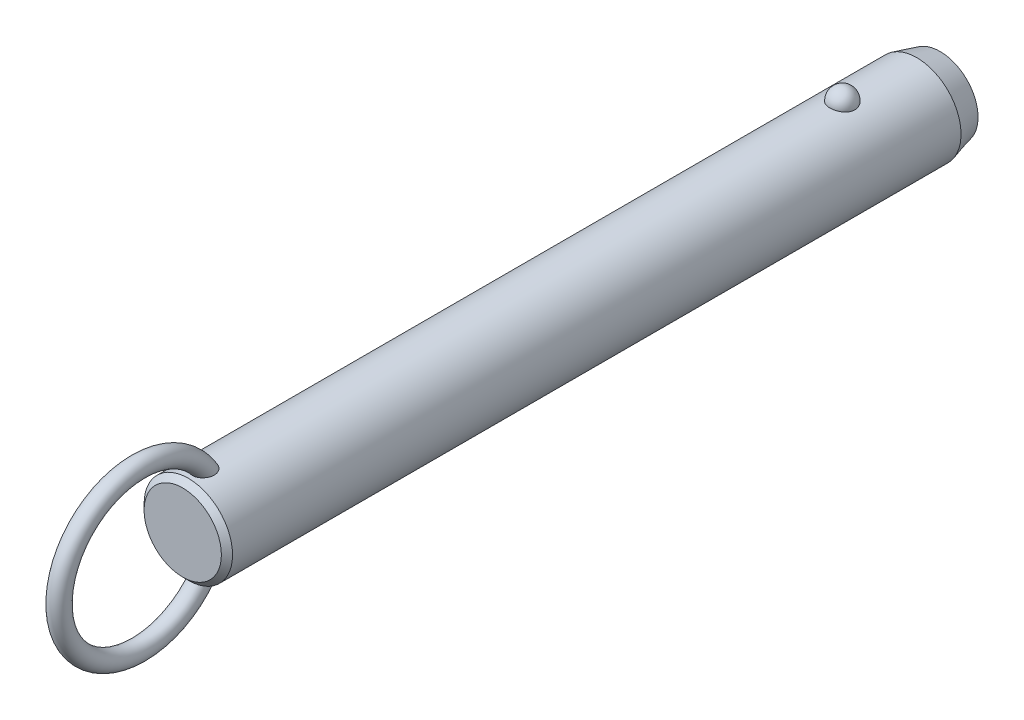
ISO-10303-21;
HEADER;
FILE_DESCRIPTION(('STEP AP214'),'2;1');
FILE_NAME('part.step','',(''),(''),'','','');
FILE_SCHEMA(('AUTOMOTIVE_DESIGN { 1 0 10303 214 1 1 1 1 }'));
ENDSEC;
DATA;
#1=APPLICATION_CONTEXT('core data for automotive mechanical design processes');
#2=APPLICATION_PROTOCOL_DEFINITION('international standard','automotive_design',2000,#1);
#3=PRODUCT_CONTEXT('',#1,'mechanical');
#4=PRODUCT('Part','Part','',(#3));
#5=PRODUCT_RELATED_PRODUCT_CATEGORY('part','',(#4));
#6=PRODUCT_DEFINITION_FORMATION('','',#4);
#7=PRODUCT_DEFINITION_CONTEXT('part definition',#1,'design');
#8=PRODUCT_DEFINITION('design','',#6,#7);
#9=PRODUCT_DEFINITION_SHAPE('','',#8);
#10=(LENGTH_UNIT() NAMED_UNIT(*) SI_UNIT(.MILLI.,.METRE.));
#11=(NAMED_UNIT(*) PLANE_ANGLE_UNIT() SI_UNIT($,.RADIAN.));
#12=(NAMED_UNIT(*) SI_UNIT($,.STERADIAN.) SOLID_ANGLE_UNIT());
#13=UNCERTAINTY_MEASURE_WITH_UNIT(LENGTH_MEASURE(1.E-05),#10,'distance_accuracy_value','');
#14=(GEOMETRIC_REPRESENTATION_CONTEXT(3) GLOBAL_UNCERTAINTY_ASSIGNED_CONTEXT((#13)) GLOBAL_UNIT_ASSIGNED_CONTEXT((#10,
#11,#12)) REPRESENTATION_CONTEXT('',''));
#15=CARTESIAN_POINT('',(0.,0.,0.));
#16=DIRECTION('',(0.,0.,1.));
#17=DIRECTION('',(1.,0.,0.));
#18=AXIS2_PLACEMENT_3D('',#15,#16,#17);
#19=CARTESIAN_POINT('',(0.,0.,129.5));
#20=DIRECTION('',(0.,0.,-1.));
#21=DIRECTION('',(-1.,0.,0.));
#22=AXIS2_PLACEMENT_3D('',#19,#20,#21);
#23=CYLINDRICAL_SURFACE('',#22,9.5);
#24=CARTESIAN_POINT('',(2.67259918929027,9.11631578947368,-2.70000000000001));
#25=CARTESIAN_POINT('',(2.6725968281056,9.11631786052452,-2.54909854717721));
#26=CARTESIAN_POINT('',(2.66030567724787,9.11994722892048,-2.39816735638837));
#27=CARTESIAN_POINT('',(2.6114347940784,9.13405924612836,-2.10058568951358));
#28=CARTESIAN_POINT('',(2.57484658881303,9.14454428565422,-1.95393672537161));
#29=CARTESIAN_POINT('',(2.47830875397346,9.17117631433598,-1.66916069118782));
#30=CARTESIAN_POINT('',(2.41836936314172,9.18732082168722,-1.53102991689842));
#31=CARTESIAN_POINT('',(2.27661331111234,9.22346780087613,-1.26705393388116));
#32=CARTESIAN_POINT('',(2.19479699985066,9.24347021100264,-1.14120852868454));
#33=CARTESIAN_POINT('',(2.01085282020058,9.28522401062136,-0.904632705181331));
#34=CARTESIAN_POINT('',(1.90862396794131,9.30698376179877,-0.793982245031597));
#35=CARTESIAN_POINT('',(1.6867437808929,9.34973971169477,-0.591607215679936));
#36=CARTESIAN_POINT('',(1.56709244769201,9.37073591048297,-0.499882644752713));
#37=CARTESIAN_POINT('',(1.31393976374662,9.40956370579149,-0.338167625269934));
#38=CARTESIAN_POINT('',(1.18048026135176,9.42740444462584,-0.268113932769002));
#39=CARTESIAN_POINT('',(0.903154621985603,9.45799906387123,-0.151390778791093));
#40=CARTESIAN_POINT('',(0.759289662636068,9.47075351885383,-0.104718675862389));
#41=CARTESIAN_POINT('',(0.468074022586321,9.48956256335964,-0.0367633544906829));
#42=CARTESIAN_POINT('',(0.320836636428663,9.49573643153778,-0.0150275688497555));
#43=CARTESIAN_POINT('',(0.0246714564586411,9.50112183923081,0.00396199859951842));
#44=CARTESIAN_POINT('',(-0.124256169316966,9.50033406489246,0.00121819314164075));
#45=CARTESIAN_POINT('',(-0.417264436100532,9.4919475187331,-0.0284441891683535));
#46=CARTESIAN_POINT('',(-0.56138413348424,9.48444885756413,-0.0550074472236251));
#47=CARTESIAN_POINT('',(-0.842986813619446,9.46357853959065,-0.131064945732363));
#48=CARTESIAN_POINT('',(-0.980469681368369,9.450206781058,-0.180559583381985));
#49=CARTESIAN_POINT('',(-1.24585005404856,9.41890822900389,-0.301476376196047));
#50=CARTESIAN_POINT('',(-1.37368611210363,9.40095498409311,-0.373026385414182));
#51=CARTESIAN_POINT('',(-1.61552738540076,9.36242964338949,-0.536025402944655));
#52=CARTESIAN_POINT('',(-1.72953116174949,9.34185727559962,-0.627476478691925));
#53=CARTESIAN_POINT('',(-1.9429225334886,9.29984568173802,-0.829844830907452));
#54=CARTESIAN_POINT('',(-2.04198021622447,9.27839736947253,-0.94110821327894));
#55=CARTESIAN_POINT('',(-2.22026460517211,9.23735994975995,-1.17883414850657));
#56=CARTESIAN_POINT('',(-2.29948985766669,9.21777097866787,-1.30529781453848));
#57=CARTESIAN_POINT('',(-2.43697287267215,9.18238994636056,-1.57158566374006));
#58=CARTESIAN_POINT('',(-2.49497068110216,9.16664569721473,-1.71155057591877));
#59=CARTESIAN_POINT('',(-2.5872073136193,9.14104303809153,-1.99961197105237));
#60=CARTESIAN_POINT('',(-2.62144683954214,9.13118445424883,-2.14770821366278));
#61=CARTESIAN_POINT('',(-2.66521466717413,9.11850622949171,-2.44715424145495));
#62=CARTESIAN_POINT('',(-2.67484831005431,9.11565658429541,-2.59848735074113));
#63=CARTESIAN_POINT('',(-2.66946735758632,9.11723375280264,-2.90067317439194));
#64=CARTESIAN_POINT('',(-2.65445345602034,9.12166036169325,-3.05152590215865));
#65=CARTESIAN_POINT('',(-2.60029711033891,9.13724422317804,-3.34766110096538));
#66=CARTESIAN_POINT('',(-2.56127978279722,9.14836656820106,-3.49296833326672));
#67=CARTESIAN_POINT('',(-2.46018844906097,9.17606676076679,-3.77477535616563));
#68=CARTESIAN_POINT('',(-2.39811349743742,9.1926448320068,-3.9112747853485));
#69=CARTESIAN_POINT('',(-2.25202303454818,9.22952198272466,-4.17244273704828));
#70=CARTESIAN_POINT('',(-2.16788714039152,9.24984129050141,-4.29704106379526));
#71=CARTESIAN_POINT('',(-1.9799408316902,9.29188255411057,-4.53013066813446));
#72=CARTESIAN_POINT('',(-1.87612963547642,9.31360456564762,-4.63862130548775));
#73=CARTESIAN_POINT('',(-1.65105429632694,9.35612959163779,-4.8369029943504));
#74=CARTESIAN_POINT('',(-1.52972405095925,9.37692871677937,-4.92661991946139));
#75=CARTESIAN_POINT('',(-1.27318250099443,9.41518970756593,-5.08429106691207));
#76=CARTESIAN_POINT('',(-1.13797219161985,9.432651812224,-5.15224684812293));
#77=CARTESIAN_POINT('',(-0.859280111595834,9.46208255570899,-5.26371827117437));
#78=CARTESIAN_POINT('',(-0.715925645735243,9.47411833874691,-5.30753421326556));
#79=CARTESIAN_POINT('',(-0.423550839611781,9.4916822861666,-5.37076321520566));
#80=CARTESIAN_POINT('',(-0.2745312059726,9.49721125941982,-5.39017930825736));
#81=CARTESIAN_POINT('',(0.0218446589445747,9.50110860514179,-5.40390587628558));
#82=CARTESIAN_POINT('',(0.16917707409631,9.49961381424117,-5.39869609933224));
#83=CARTESIAN_POINT('',(0.460808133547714,9.48993906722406,-5.36441955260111));
#84=CARTESIAN_POINT('',(0.605106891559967,9.48175936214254,-5.33535367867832));
#85=CARTESIAN_POINT('',(0.886027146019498,9.4596376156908,-5.25435587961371));
#86=CARTESIAN_POINT('',(1.02267710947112,9.44571881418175,-5.20251612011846));
#87=CARTESIAN_POINT('',(1.28523827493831,9.41358993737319,-5.07741549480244));
#88=CARTESIAN_POINT('',(1.41114877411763,9.39537958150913,-5.00415322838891));
#89=CARTESIAN_POINT('',(1.65085227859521,9.3562644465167,-4.83684599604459));
#90=CARTESIAN_POINT('',(1.76442346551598,9.33532178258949,-4.74249218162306));
#91=CARTESIAN_POINT('',(1.97425672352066,9.29321198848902,-4.53620389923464));
#92=CARTESIAN_POINT('',(2.07051582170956,9.27204482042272,-4.42426641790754));
#93=CARTESIAN_POINT('',(2.24490086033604,9.23139221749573,-4.18363183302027));
#94=CARTESIAN_POINT('',(2.32267019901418,9.21194380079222,-4.05466990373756));
#95=CARTESIAN_POINT('',(2.45584092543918,9.1773419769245,-3.78517836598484));
#96=CARTESIAN_POINT('',(2.5112497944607,9.16218713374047,-3.64465264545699));
#97=CARTESIAN_POINT('',(2.59380876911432,9.13913522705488,-3.37104301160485));
#98=CARTESIAN_POINT('',(2.62330266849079,9.13064624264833,-3.23871053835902));
#99=CARTESIAN_POINT('',(2.66269870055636,9.11923566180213,-2.97092664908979));
#100=CARTESIAN_POINT('',(2.67260130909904,9.11631393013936,-2.83547530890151));
#101=CARTESIAN_POINT('',(2.67259918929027,9.11631578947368,-2.70000000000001));
#102=B_SPLINE_CURVE_WITH_KNOTS('',3,(#24,#25,#26,#27,#28,#29,#30,#31,#32,#33,#34,#35,#36,#37,
#38,#39,#40,#41,#42,#43,#44,#45,#46,#47,#48,#49,#50,#51,#52,#53,#54,#55,#56,#57,#58,#59,#60,#61,
#62,#63,#64,#65,#66,#67,#68,#69,#70,#71,#72,#73,#74,#75,#76,#77,#78,#79,#80,#81,#82,#83,#84,#85,
#86,#87,#88,#89,#90,#91,#92,#93,#94,#95,#96,#97,#98,#99,#100,#101),.UNSPECIFIED.,.T.,.F.,(4,2,2,
2,2,2,2,2,2,2,2,2,2,2,2,2,2,2,2,2,2,2,2,2,2,2,2,2,2,2,2,2,2,2,2,2,2,2,4),(0.,0.452217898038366,
0.904593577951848,1.35677112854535,1.80894144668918,2.26340676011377,2.71787203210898,
3.17099820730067,3.62407318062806,4.0687883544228,4.51345969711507,4.95160616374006,
5.38976021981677,5.83050358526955,6.27129275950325,6.72071308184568,7.17016633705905,
7.62495278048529,8.07972578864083,8.53254856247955,8.98535859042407,9.43582813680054,
9.88631615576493,10.3393155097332,10.7923328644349,11.2471065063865,11.7018475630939,
12.150795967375,12.599688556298,13.0398725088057,13.4800399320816,13.9184421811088,
14.3568730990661,14.802202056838,15.2476074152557,15.7010097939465,16.1542603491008,
16.5602594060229,16.966248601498),.UNSPECIFIED.);
#103=CARTESIAN_POINT('',(2.67259918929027,9.11631578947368,-2.70000000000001));
#104=VERTEX_POINT('',#103);
#105=EDGE_CURVE('E41',#104,#104,#102,.T.);
#106=ORIENTED_EDGE('',*,*,#105,.T.);
#107=EDGE_LOOP('',(#106));
#108=FACE_BOUND('',#107,.T.);
#109=CARTESIAN_POINT('',(0.,0.,137.82));
#110=DIRECTION('',(0.,0.,1.));
#111=DIRECTION('',(1.,0.,0.));
#112=AXIS2_PLACEMENT_3D('',#109,#110,#111);
#113=CIRCLE('',#112,9.5);
#114=CARTESIAN_POINT('',(9.5,0.,137.82));
#115=VERTEX_POINT('',#114);
#116=EDGE_CURVE('E10',#115,#115,#113,.F.);
#117=ORIENTED_EDGE('',*,*,#116,.T.);
#118=EDGE_LOOP('',(#117));
#119=FACE_BOUND('',#118,.T.);
#120=CARTESIAN_POINT('',(-0.697062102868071,-9.47439269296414,132.167808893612));
#121=CARTESIAN_POINT('',(-0.799579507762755,-9.46685146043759,132.207482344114));
#122=CARTESIAN_POINT('',(-0.898575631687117,-9.45788043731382,132.2559309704));
#123=CARTESIAN_POINT('',(-1.08670047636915,-9.43811593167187,132.368868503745));
#124=CARTESIAN_POINT('',(-1.17583204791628,-9.42732297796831,132.433352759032));
#125=CARTESIAN_POINT('',(-1.34179806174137,-9.40513672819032,132.576209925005));
#126=CARTESIAN_POINT('',(-1.41865133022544,-9.39374438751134,132.654561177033));
#127=CARTESIAN_POINT('',(-1.55860047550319,-9.37154196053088,132.822752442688));
#128=CARTESIAN_POINT('',(-1.62169476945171,-9.3607319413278,132.91259377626));
#129=CARTESIAN_POINT('',(-1.73527695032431,-9.34035749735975,133.104500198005));
#130=CARTESIAN_POINT('',(-1.78522266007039,-9.33085270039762,133.206891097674));
#131=CARTESIAN_POINT('',(-1.86924997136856,-9.3143834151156,133.418148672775));
#132=CARTESIAN_POINT('',(-1.90332570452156,-9.30741986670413,133.527017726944));
#133=CARTESIAN_POINT('',(-1.95893603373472,-9.29588482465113,133.760473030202));
#134=CARTESIAN_POINT('',(-1.97872420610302,-9.29165182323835,133.885489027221));
#135=CARTESIAN_POINT('',(-2.00062129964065,-9.28695978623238,134.137080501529));
#136=CARTESIAN_POINT('',(-2.00272284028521,-9.28650232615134,134.263656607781));
#137=CARTESIAN_POINT('',(-1.98958876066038,-9.28932750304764,134.536815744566));
#138=CARTESIAN_POINT('',(-1.97143366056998,-9.2932400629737,134.683251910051));
#139=CARTESIAN_POINT('',(-1.91479925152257,-9.30507151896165,134.972062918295));
#140=CARTESIAN_POINT('',(-1.87629122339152,-9.31299607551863,135.114431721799));
#141=CARTESIAN_POINT('',(-1.77225683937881,-9.33340232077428,135.415172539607));
#142=CARTESIAN_POINT('',(-1.70334898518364,-9.34641636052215,135.572369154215));
#143=CARTESIAN_POINT('',(-1.58111062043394,-9.36759153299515,135.797517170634));
#144=CARTESIAN_POINT('',(-1.53721459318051,-9.37492619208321,135.870796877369));
#145=CARTESIAN_POINT('',(-1.4430263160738,-9.38988566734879,136.01307405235));
#146=CARTESIAN_POINT('',(-1.39273721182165,-9.39751033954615,136.082073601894));
#147=CARTESIAN_POINT('',(-1.26775962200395,-9.41530678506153,136.236983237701));
#148=CARTESIAN_POINT('',(-1.19052326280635,-9.42548108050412,136.320871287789));
#149=CARTESIAN_POINT('',(-1.02420241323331,-9.44499825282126,136.476008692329));
#150=CARTESIAN_POINT('',(-0.93513986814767,-9.45434261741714,136.547280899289));
#151=CARTESIAN_POINT('',(-0.766610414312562,-9.46930670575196,136.658695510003));
#152=CARTESIAN_POINT('',(-0.689439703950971,-9.47529223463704,136.702235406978));
#153=CARTESIAN_POINT('',(-0.528942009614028,-9.48560294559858,136.77631336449));
#154=CARTESIAN_POINT('',(-0.445620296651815,-9.48992953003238,136.806862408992));
#155=CARTESIAN_POINT('',(-0.273901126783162,-9.49644161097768,136.852579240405));
#156=CARTESIAN_POINT('',(-0.18546574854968,-9.49860811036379,136.86761059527));
#157=CARTESIAN_POINT('',(-0.00734541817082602,-9.5004135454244,136.880149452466));
#158=CARTESIAN_POINT('',(0.0823387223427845,-9.50005405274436,136.877667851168));
#159=CARTESIAN_POINT('',(0.24767927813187,-9.49708301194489,136.856995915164));
#160=CARTESIAN_POINT('',(0.323620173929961,-9.49477609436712,136.840930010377));
#161=CARTESIAN_POINT('',(0.471981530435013,-9.48855917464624,136.797172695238));
#162=CARTESIAN_POINT('',(0.544400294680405,-9.48464840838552,136.769475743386));
#163=CARTESIAN_POINT('',(0.708947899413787,-9.47398336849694,136.69280266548));
#164=CARTESIAN_POINT('',(0.799149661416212,-9.46671310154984,136.639774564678));
#165=CARTESIAN_POINT('',(0.969783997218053,-9.45076225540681,136.519973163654));
#166=CARTESIAN_POINT('',(1.050194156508,-9.44207854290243,136.453169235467));
#167=CARTESIAN_POINT('',(1.23092343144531,-9.42051459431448,136.280759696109));
#168=CARTESIAN_POINT('',(1.32652499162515,-9.40733378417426,136.17026193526));
#169=CARTESIAN_POINT('',(1.49893121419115,-9.38140745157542,135.935561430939));
#170=CARTESIAN_POINT('',(1.5757161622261,-9.36866239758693,135.811344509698));
#171=CARTESIAN_POINT('',(1.71285426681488,-9.34457644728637,135.549389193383));
#172=CARTESIAN_POINT('',(1.77266365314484,-9.33328726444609,135.41136233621));
#173=CARTESIAN_POINT('',(1.87239208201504,-9.31379209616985,135.128051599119));
#174=CARTESIAN_POINT('',(1.91230158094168,-9.3055875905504,134.982764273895));
#175=CARTESIAN_POINT('',(1.97604189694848,-9.29228394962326,134.662028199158));
#176=CARTESIAN_POINT('',(1.9958743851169,-9.28797202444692,134.485724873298));
#177=CARTESIAN_POINT('',(2.0029570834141,-9.28645519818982,134.132414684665));
#178=CARTESIAN_POINT('',(1.99025930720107,-9.28923895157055,133.955409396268));
#179=CARTESIAN_POINT('',(1.93735479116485,-9.30038134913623,133.656338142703));
#180=CARTESIAN_POINT('',(1.90576827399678,-9.30697680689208,133.532667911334));
#181=CARTESIAN_POINT('',(1.8228748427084,-9.32356855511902,133.292329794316));
#182=CARTESIAN_POINT('',(1.77158213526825,-9.33356239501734,133.175656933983));
#183=CARTESIAN_POINT('',(1.64885744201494,-9.35602275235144,132.952706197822));
#184=CARTESIAN_POINT('',(1.57730995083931,-9.36850332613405,132.846492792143));
#185=CARTESIAN_POINT('',(1.41543264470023,-9.39431873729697,132.649553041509));
#186=CARTESIAN_POINT('',(1.32510883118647,-9.40765330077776,132.558821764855));
#187=CARTESIAN_POINT('',(1.13846223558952,-9.43195720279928,132.405033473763));
#188=CARTESIAN_POINT('',(1.04369890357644,-9.44302894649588,132.340094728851));
#189=CARTESIAN_POINT('',(0.843965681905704,-9.46296805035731,132.228038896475));
#190=CARTESIAN_POINT('',(0.739000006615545,-9.47183631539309,132.180914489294));
#191=CARTESIAN_POINT('',(0.528175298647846,-9.48586140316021,132.108117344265));
#192=CARTESIAN_POINT('',(0.422686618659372,-9.49119633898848,132.08140249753));
#193=CARTESIAN_POINT('',(0.208590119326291,-9.49831365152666,132.046013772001));
#194=CARTESIAN_POINT('',(0.0999817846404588,-9.500095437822,132.037342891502));
#195=CARTESIAN_POINT('',(-0.126104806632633,-9.49988861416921,132.038350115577));
#196=CARTESIAN_POINT('',(-0.243578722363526,-9.49757821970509,132.049594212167));
#197=CARTESIAN_POINT('',(-0.474390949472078,-9.48885165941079,132.093167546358));
#198=CARTESIAN_POINT('',(-0.587729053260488,-9.48243528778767,132.125497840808));
#199=CARTESIAN_POINT('',(-0.697062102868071,-9.47439269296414,132.167808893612));
#200=B_SPLINE_CURVE_WITH_KNOTS('',3,(#120,#121,#122,#123,#124,#125,#126,#127,#128,#129,#130,
#131,#132,#133,#134,#135,#136,#137,#138,#139,#140,#141,#142,#143,#144,#145,#146,#147,#148,#149,
#150,#151,#152,#153,#154,#155,#156,#157,#158,#159,#160,#161,#162,#163,#164,#165,#166,#167,#168,
#169,#170,#171,#172,#173,#174,#175,#176,#177,#178,#179,#180,#181,#182,#183,#184,#185,#186,#187,
#188,#189,#190,#191,#192,#193,#194,#195,#196,#197,#198,#199),.UNSPECIFIED.,.T.,.F.,(4,2,2,2,2,2,
2,2,2,2,2,2,2,2,2,2,2,2,2,2,2,2,2,2,2,2,2,2,2,2,2,2,2,2,2,2,2,2,2,4),(0.,0.330119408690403,
0.660143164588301,0.989655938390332,1.31920659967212,1.66074728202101,2.00241415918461,
2.38088696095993,2.75951768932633,3.20065679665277,3.64242004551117,4.15620996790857,
4.4131416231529,4.66994734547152,5.01228664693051,5.35399933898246,5.61943037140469,
5.88463652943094,6.15215502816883,6.4195070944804,6.65144391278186,6.88349136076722,
7.19641200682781,7.51003602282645,7.94779711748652,8.3860149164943,8.83699707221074,
9.28819530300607,9.81778662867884,10.34653170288,10.7284172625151,11.1100280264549,
11.4938603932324,11.8775702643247,12.2220189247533,12.5663259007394,12.8915939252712,
13.2169159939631,13.5689650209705,13.9210316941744),.UNSPECIFIED.);
#201=CARTESIAN_POINT('',(-0.697062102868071,-9.47439269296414,132.167808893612));
#202=VERTEX_POINT('',#201);
#203=EDGE_CURVE('E59',#202,#202,#200,.T.);
#204=ORIENTED_EDGE('',*,*,#203,.T.);
#205=EDGE_LOOP('',(#204));
#206=FACE_BOUND('',#205,.T.);
#207=CARTESIAN_POINT('',(-0.697062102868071,9.47439269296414,132.167808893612));
#208=CARTESIAN_POINT('',(-0.597792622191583,9.48169483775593,132.12939564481));
#209=CARTESIAN_POINT('',(-0.495106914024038,9.48766580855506,132.099168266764));
#210=CARTESIAN_POINT('',(-0.285876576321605,9.49627648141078,132.056032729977));
#211=CARTESIAN_POINT('',(-0.179324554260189,9.49890941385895,132.043159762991));
#212=CARTESIAN_POINT('',(0.0344157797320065,9.50053798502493,132.035166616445));
#213=CARTESIAN_POINT('',(0.141603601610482,9.49953613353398,132.040034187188));
#214=CARTESIAN_POINT('',(0.35356357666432,9.49401038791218,132.067365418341));
#215=CARTESIAN_POINT('',(0.458336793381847,9.48948807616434,132.08982117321));
#216=CARTESIAN_POINT('',(0.662493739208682,9.4774236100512,132.151671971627));
#217=CARTESIAN_POINT('',(0.761881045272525,9.46988348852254,132.191055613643));
#218=CARTESIAN_POINT('',(0.952608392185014,9.45260382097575,132.285634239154));
#219=CARTESIAN_POINT('',(1.04394806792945,9.44286417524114,132.340829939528));
#220=CARTESIAN_POINT('',(1.21712767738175,9.42211760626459,132.466066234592));
#221=CARTESIAN_POINT('',(1.29885671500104,9.41109835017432,132.536257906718));
#222=CARTESIAN_POINT('',(1.44978975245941,9.38903310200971,132.688980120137));
#223=CARTESIAN_POINT('',(1.51899278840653,9.37798710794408,132.771511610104));
#224=CARTESIAN_POINT('',(1.64602857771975,9.35654375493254,132.949776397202));
#225=CARTESIAN_POINT('',(1.70333052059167,9.34618688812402,133.045891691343));
#226=CARTESIAN_POINT('',(1.80259341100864,9.32755128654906,133.245897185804));
#227=CARTESIAN_POINT('',(1.84454942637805,9.31927322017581,133.349789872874));
#228=CARTESIAN_POINT('',(1.91637039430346,9.30478365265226,133.572213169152));
#229=CARTESIAN_POINT('',(1.944805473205,9.29882552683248,133.691219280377));
#230=CARTESIAN_POINT('',(1.98449865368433,9.29043398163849,133.932143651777));
#231=CARTESIAN_POINT('',(1.99574908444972,9.28800213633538,134.054063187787));
#232=CARTESIAN_POINT('',(2.00275141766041,9.28649645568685,134.316932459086));
#233=CARTESIAN_POINT('',(1.99588238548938,9.28799035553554,134.457952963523));
#234=CARTESIAN_POINT('',(1.96270559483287,9.29505517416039,134.737621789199));
#235=CARTESIAN_POINT('',(1.93637872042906,9.30063010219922,134.876267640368));
#236=CARTESIAN_POINT('',(1.85949176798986,9.31633564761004,135.172561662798));
#237=CARTESIAN_POINT('',(1.80549792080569,9.3270926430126,135.329290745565));
#238=CARTESIAN_POINT('',(1.67376869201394,9.3516306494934,135.632284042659));
#239=CARTESIAN_POINT('',(1.59603181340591,9.36541185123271,135.778547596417));
#240=CARTESIAN_POINT('',(1.4360277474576,9.39110706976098,136.025813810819));
#241=CARTESIAN_POINT('',(1.35831795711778,9.40278656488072,136.129791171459));
#242=CARTESIAN_POINT('',(1.18774483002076,9.42585025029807,136.324534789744));
#243=CARTESIAN_POINT('',(1.09490932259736,9.43723493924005,136.415324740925));
#244=CARTESIAN_POINT('',(0.921110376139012,9.45552616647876,136.55620334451));
#245=CARTESIAN_POINT('',(0.843738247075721,9.46281058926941,136.610656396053));
#246=CARTESIAN_POINT('',(0.681245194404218,9.47589120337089,136.706711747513));
#247=CARTESIAN_POINT('',(0.596135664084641,9.48168953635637,136.748332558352));
#248=CARTESIAN_POINT('',(0.433779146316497,9.49038144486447,136.810089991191));
#249=CARTESIAN_POINT('',(0.357459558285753,9.49359170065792,136.83260136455));
#250=CARTESIAN_POINT('',(0.202074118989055,9.49816761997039,136.864574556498));
#251=CARTESIAN_POINT('',(0.123010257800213,9.49953459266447,136.874045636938));
#252=CARTESIAN_POINT('',(-0.0357372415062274,9.50026497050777,136.879114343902));
#253=CARTESIAN_POINT('',(-0.115421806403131,9.49962433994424,136.874684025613));
#254=CARTESIAN_POINT('',(-0.272823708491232,9.49640854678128,136.852296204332));
#255=CARTESIAN_POINT('',(-0.350540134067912,9.4938325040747,136.834332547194));
#256=CARTESIAN_POINT('',(-0.500580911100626,9.48709462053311,136.786802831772));
#257=CARTESIAN_POINT('',(-0.572979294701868,9.48296359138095,136.757461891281));
#258=CARTESIAN_POINT('',(-0.712864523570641,9.47347609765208,136.689008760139));
#259=CARTESIAN_POINT('',(-0.780349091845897,9.46811906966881,136.649892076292));
#260=CARTESIAN_POINT('',(-0.946309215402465,9.45329720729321,136.539432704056));
#261=CARTESIAN_POINT('',(-1.04090230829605,9.44321512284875,136.462329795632));
#262=CARTESIAN_POINT('',(-1.21661929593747,9.42219227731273,136.29409718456));
#263=CARTESIAN_POINT('',(-1.29770519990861,9.41124921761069,136.202929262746));
#264=CARTESIAN_POINT('',(-1.47319646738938,9.38563439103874,135.976162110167));
#265=CARTESIAN_POINT('',(-1.56208878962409,9.37102009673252,135.836289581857));
#266=CARTESIAN_POINT('',(-1.71623987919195,9.34401559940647,135.543950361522));
#267=CARTESIAN_POINT('',(-1.78147866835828,9.33162728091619,135.391473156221));
#268=CARTESIAN_POINT('',(-1.88853837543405,9.31055541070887,135.075647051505));
#269=CARTESIAN_POINT('',(-1.92998995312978,9.30193076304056,134.912168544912));
#270=CARTESIAN_POINT('',(-1.98590726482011,9.29015757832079,134.580526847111));
#271=CARTESIAN_POINT('',(-2.0004070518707,9.2870021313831,134.412369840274));
#272=CARTESIAN_POINT('',(-1.99964701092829,9.28716218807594,134.105080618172));
#273=CARTESIAN_POINT('',(-1.98908145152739,9.28945704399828,133.965936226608));
#274=CARTESIAN_POINT('',(-1.94566294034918,9.29865169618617,133.691153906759));
#275=CARTESIAN_POINT('',(-1.9128206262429,9.30554929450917,133.555514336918));
#276=CARTESIAN_POINT('',(-1.84582133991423,9.31898248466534,133.357802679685));
#277=CARTESIAN_POINT('',(-1.82038084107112,9.32400364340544,133.292583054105));
#278=CARTESIAN_POINT('',(-1.76350511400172,9.33492884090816,133.164903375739));
#279=CARTESIAN_POINT('',(-1.73207305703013,9.34083241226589,133.102441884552));
#280=CARTESIAN_POINT('',(-1.66324243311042,9.35333332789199,132.98094078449));
#281=CARTESIAN_POINT('',(-1.62584239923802,9.35993084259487,132.921902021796));
#282=CARTESIAN_POINT('',(-1.54527678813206,9.37356864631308,132.807987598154));
#283=CARTESIAN_POINT('',(-1.50211241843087,9.38060884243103,132.753111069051));
#284=CARTESIAN_POINT('',(-1.37681147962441,9.40004442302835,132.609961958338));
#285=CARTESIAN_POINT('',(-1.28916358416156,9.41261047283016,132.526429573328));
#286=CARTESIAN_POINT('',(-1.09996826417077,9.43658180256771,132.377236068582));
#287=CARTESIAN_POINT('',(-0.998461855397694,9.44799034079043,132.311523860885));
#288=CARTESIAN_POINT('',(-0.860188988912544,9.46103017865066,132.2394367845));
#289=CARTESIAN_POINT('',(-0.828141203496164,9.46389141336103,132.223851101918));
#290=CARTESIAN_POINT('',(-0.763210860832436,9.46934915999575,132.194473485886));
#291=CARTESIAN_POINT('',(-0.730328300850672,9.47194567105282,132.180681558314));
#292=CARTESIAN_POINT('',(-0.697062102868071,9.47439269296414,132.167808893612));
#293=B_SPLINE_CURVE_WITH_KNOTS('',3,(#207,#208,#209,#210,#211,#212,#213,#214,#215,#216,#217,
#218,#219,#220,#221,#222,#223,#224,#225,#226,#227,#228,#229,#230,#231,#232,#233,#234,#235,#236,
#237,#238,#239,#240,#241,#242,#243,#244,#245,#246,#247,#248,#249,#250,#251,#252,#253,#254,#255,
#256,#257,#258,#259,#260,#261,#262,#263,#264,#265,#266,#267,#268,#269,#270,#271,#272,#273,#274,
#275,#276,#277,#278,#279,#280,#281,#282,#283,#284,#285,#286,#287,#288,#289,#290,#291,#292),
.UNSPECIFIED.,.T.,.F.,(4,2,2,2,2,2,2,2,2,2,2,2,2,2,2,2,2,2,2,2,2,2,2,2,2,2,2,2,2,2,2,2,2,2,2,2,
2,2,2,2,2,2,4),(0.,0.319942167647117,0.640532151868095,0.96090081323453,1.2811255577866,
1.60113495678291,1.92115886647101,2.24457323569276,2.56801248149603,2.90371927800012,
3.23953387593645,3.60560313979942,3.97183576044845,4.39383693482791,4.8162532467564,
5.31257045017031,5.80891895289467,6.19868344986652,6.58773876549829,6.87145417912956,
7.15475838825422,7.39263751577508,7.63034760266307,7.86853584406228,8.10683246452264,
8.3406366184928,8.57454843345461,8.93983939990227,9.30614105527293,9.80266668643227,
10.2996107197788,10.8040753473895,11.3079021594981,11.7249776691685,12.1418541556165,
12.3521485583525,12.5623319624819,12.7725671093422,12.9827582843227,13.345827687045,
13.7078449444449,13.8150604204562,13.9222762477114),.UNSPECIFIED.);
#294=CARTESIAN_POINT('',(-0.697062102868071,9.47439269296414,132.167808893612));
#295=VERTEX_POINT('',#294);
#296=EDGE_CURVE('E66',#295,#295,#293,.T.);
#297=ORIENTED_EDGE('',*,*,#296,.T.);
#298=EDGE_LOOP('',(#297));
#299=FACE_BOUND('',#298,.T.);
#300=CARTESIAN_POINT('',(0.,0.,-18.7));
#301=DIRECTION('',(0.,0.,-1.));
#302=DIRECTION('',(-1.,0.,0.));
#303=AXIS2_PLACEMENT_3D('',#300,#301,#302);
#304=CIRCLE('',#303,9.5);
#305=CARTESIAN_POINT('',(-9.5,0.,-18.7));
#306=VERTEX_POINT('',#305);
#307=EDGE_CURVE('E56',#306,#306,#304,.F.);
#308=ORIENTED_EDGE('',*,*,#307,.T.);
#309=EDGE_LOOP('',(#308));
#310=FACE_BOUND('',#309,.T.);
#311=ADVANCED_FACE('F37',(#108,#119,#206,#299,#310),#23,.T.);
#312=CARTESIAN_POINT('',(0.,0.,-23.7));
#313=DIRECTION('',(0.,0.,-1.));
#314=DIRECTION('',(-1.,0.,0.));
#315=AXIS2_PLACEMENT_3D('',#312,#313,#314);
#316=PLANE('',#315);
#317=CARTESIAN_POINT('',(0.,0.,-23.7));
#318=DIRECTION('',(0.,0.,-1.));
#319=DIRECTION('',(-1.,0.,0.));
#320=AXIS2_PLACEMENT_3D('',#317,#318,#319);
#321=CIRCLE('',#320,8.16025403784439);
#322=CARTESIAN_POINT('',(-8.16025403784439,0.,-23.7));
#323=VERTEX_POINT('',#322);
#324=EDGE_CURVE('E65',#323,#323,#321,.T.);
#325=ORIENTED_EDGE('',*,*,#324,.T.);
#326=EDGE_LOOP('',(#325));
#327=FACE_BOUND('',#326,.T.);
#328=ADVANCED_FACE('F84',(#327),#316,.T.);
#329=CARTESIAN_POINT('',(0.,0.,-23.7));
#330=DIRECTION('',(0.,0.,1.));
#331=DIRECTION('',(1.,0.,0.));
#332=AXIS2_PLACEMENT_3D('',#329,#330,#331);
#333=CONICAL_SURFACE('',#332,8.16025403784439,0.261799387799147);
#334=ORIENTED_EDGE('',*,*,#307,.F.);
#335=EDGE_LOOP('',(#334));
#336=FACE_BOUND('',#335,.T.);
#337=ORIENTED_EDGE('',*,*,#324,.F.);
#338=EDGE_LOOP('',(#337));
#339=FACE_BOUND('',#338,.T.);
#340=ADVANCED_FACE('F82',(#336,#339),#333,.T.);
#341=CARTESIAN_POINT('',(0.,0.,139.02));
#342=DIRECTION('',(0.,0.,1.));
#343=DIRECTION('',(1.,0.,0.));
#344=AXIS2_PLACEMENT_3D('',#341,#342,#343);
#345=PLANE('',#344);
#346=CARTESIAN_POINT('',(0.,0.,139.02));
#347=DIRECTION('',(0.,0.,1.));
#348=DIRECTION('',(1.,0.,0.));
#349=AXIS2_PLACEMENT_3D('',#346,#347,#348);
#350=CIRCLE('',#349,8.3);
#351=CARTESIAN_POINT('',(8.3,0.,139.02));
#352=VERTEX_POINT('',#351);
#353=EDGE_CURVE('E50',#352,#352,#350,.T.);
#354=ORIENTED_EDGE('',*,*,#353,.T.);
#355=EDGE_LOOP('',(#354));
#356=FACE_BOUND('',#355,.T.);
#357=ADVANCED_FACE('F76',(#356),#345,.T.);
#358=CARTESIAN_POINT('',(0.,0.,148.55));
#359=DIRECTION('',(1.,0.,0.));
#360=DIRECTION('',(0.,0.,-1.));
#361=AXIS2_PLACEMENT_3D('',#358,#359,#360);
#362=TOROIDAL_SURFACE('',#361,17.05,2.);
#363=ORIENTED_EDGE('',*,*,#296,.F.);
#364=EDGE_LOOP('',(#363));
#365=FACE_BOUND('',#364,.T.);
#366=ORIENTED_EDGE('',*,*,#203,.F.);
#367=EDGE_LOOP('',(#366));
#368=FACE_BOUND('',#367,.T.);
#369=ADVANCED_FACE('F72',(#365,#368),#362,.T.);
#370=CARTESIAN_POINT('',(0.,0.,139.02));
#371=DIRECTION('',(0.,0.,-1.));
#372=DIRECTION('',(-1.,0.,0.));
#373=AXIS2_PLACEMENT_3D('',#370,#371,#372);
#374=CONICAL_SURFACE('',#373,8.3,0.785398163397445);
#375=ORIENTED_EDGE('',*,*,#116,.F.);
#376=EDGE_LOOP('',(#375));
#377=FACE_BOUND('',#376,.T.);
#378=ORIENTED_EDGE('',*,*,#353,.F.);
#379=EDGE_LOOP('',(#378));
#380=FACE_BOUND('',#379,.T.);
#381=ADVANCED_FACE('F39',(#377,#380),#374,.T.);
#382=CARTESIAN_POINT('',(0.,9.5,-2.70000000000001));
#383=DIRECTION('',(0.,1.,0.));
#384=DIRECTION('',(0.,0.,-1.));
#385=AXIS2_PLACEMENT_3D('',#382,#383,#384);
#386=SPHERICAL_SURFACE('',#385,2.7);
#387=ORIENTED_EDGE('',*,*,#105,.F.);
#388=EDGE_LOOP('',(#387));
#389=FACE_BOUND('',#388,.T.);
#390=ADVANCED_FACE('F78',(#389),#386,.T.);
#391=CLOSED_SHELL('',(#311,#328,#340,#357,#369,#381,#390));
#392=MANIFOLD_SOLID_BREP('B2',#391);
#393=ADVANCED_BREP_SHAPE_REPRESENTATION('',(#18,#392),#14);
#394=SHAPE_DEFINITION_REPRESENTATION(#9,#393);
ENDSEC;
END-ISO-10303-21;
